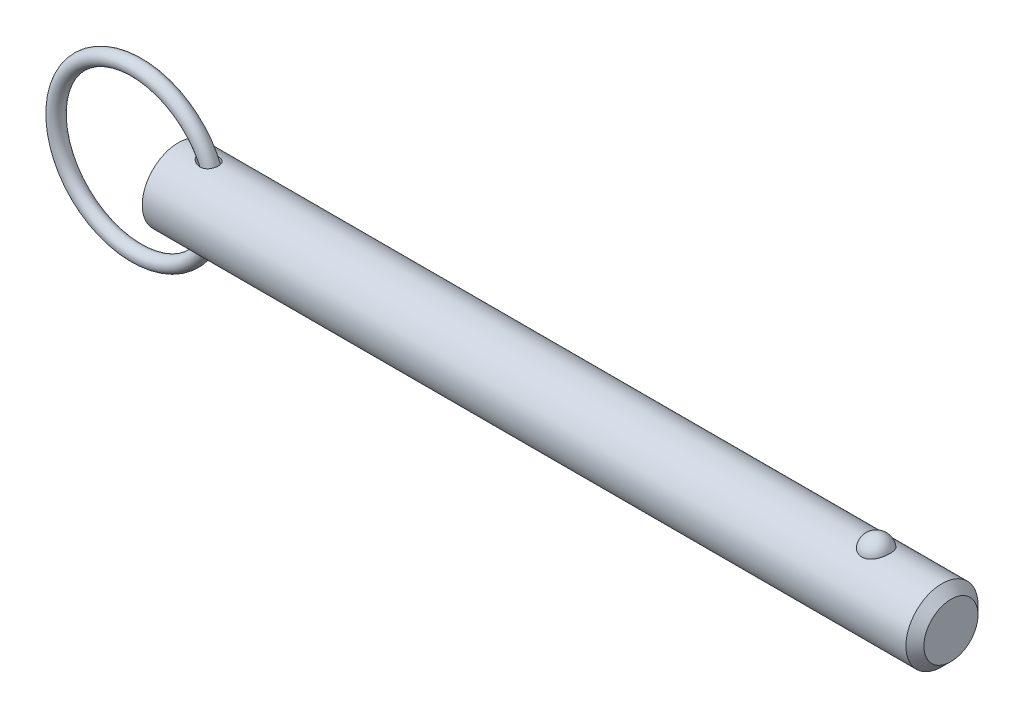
ISO-10303-21;
HEADER;
FILE_DESCRIPTION(('STEP AP214'),'2;1');
FILE_NAME('part.step','',(''),(''),'','','');
FILE_SCHEMA(('AUTOMOTIVE_DESIGN { 1 0 10303 214 1 1 1 1 }'));
ENDSEC;
DATA;
#1=APPLICATION_CONTEXT('core data for automotive mechanical design processes');
#2=APPLICATION_PROTOCOL_DEFINITION('international standard','automotive_design',2000,#1);
#3=PRODUCT_CONTEXT('',#1,'mechanical');
#4=PRODUCT('Part','Part','',(#3));
#5=PRODUCT_RELATED_PRODUCT_CATEGORY('part','',(#4));
#6=PRODUCT_DEFINITION_FORMATION('','',#4);
#7=PRODUCT_DEFINITION_CONTEXT('part definition',#1,'design');
#8=PRODUCT_DEFINITION('design','',#6,#7);
#9=PRODUCT_DEFINITION_SHAPE('','',#8);
#10=(LENGTH_UNIT() NAMED_UNIT(*) SI_UNIT(.MILLI.,.METRE.));
#11=(NAMED_UNIT(*) PLANE_ANGLE_UNIT() SI_UNIT($,.RADIAN.));
#12=(NAMED_UNIT(*) SI_UNIT($,.STERADIAN.) SOLID_ANGLE_UNIT());
#13=UNCERTAINTY_MEASURE_WITH_UNIT(LENGTH_MEASURE(1.E-05),#10,'distance_accuracy_value','');
#14=(GEOMETRIC_REPRESENTATION_CONTEXT(3) GLOBAL_UNCERTAINTY_ASSIGNED_CONTEXT((#13)) GLOBAL_UNIT_ASSIGNED_CONTEXT((#10,
#11,#12)) REPRESENTATION_CONTEXT('',''));
#15=CARTESIAN_POINT('',(0.,0.,0.));
#16=DIRECTION('',(0.,0.,1.));
#17=DIRECTION('',(1.,0.,0.));
#18=AXIS2_PLACEMENT_3D('',#15,#16,#17);
#19=CARTESIAN_POINT('',(-8.23730968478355,0.,0.));
#20=DIRECTION('',(0.,0.,1.));
#21=DIRECTION('',(1.,0.,0.));
#22=AXIS2_PLACEMENT_3D('',#19,#20,#21);
#23=TOROIDAL_SURFACE('',#22,15.875,1.422);
#24=CARTESIAN_POINT('',(9.05969031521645,0.,0.));
#25=VERTEX_POINT('',#24);
#26=VERTEX_LOOP('',#25);
#27=FACE_BOUND('',#26,.T.);
#28=ADVANCED_FACE('P0_F12',(#27),#23,.T.);
#29=CLOSED_SHELL('',(#28));
#30=MANIFOLD_SOLID_BREP('P0_B1',#29);
#31=CARTESIAN_POINT('',(0.,0.,0.));
#32=DIRECTION('',(1.,0.,0.));
#33=DIRECTION('',(0.,0.,-1.));
#34=AXIS2_PLACEMENT_3D('',#31,#32,#33);
#35=CYLINDRICAL_SURFACE('',#34,7.11);
#36=CARTESIAN_POINT('',(3.98467340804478,7.10072679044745,-0.363013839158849));
#37=CARTESIAN_POINT('',(4.00971652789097,7.09600153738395,-0.45539194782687));
#38=CARTESIAN_POINT('',(4.04401947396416,7.08958406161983,-0.545230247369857));
#39=CARTESIAN_POINT('',(4.12810160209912,7.07427055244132,-0.717157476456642));
#40=CARTESIAN_POINT('',(4.17791765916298,7.06536861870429,-0.799227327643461));
#41=CARTESIAN_POINT('',(4.28924471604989,7.04620300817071,-0.953469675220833));
#42=CARTESIAN_POINT('',(4.35063580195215,7.035953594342,-1.02573162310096));
#43=CARTESIAN_POINT('',(4.48282610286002,7.01493313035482,-1.16081412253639));
#44=CARTESIAN_POINT('',(4.55362244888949,7.00416223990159,-1.22363754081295));
#45=CARTESIAN_POINT('',(4.71659336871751,6.98090398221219,-1.35055080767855));
#46=CARTESIAN_POINT('',(4.81029272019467,6.96847103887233,-1.41269256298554));
#47=CARTESIAN_POINT('',(5.0057240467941,6.94515366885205,-1.52319699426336));
#48=CARTESIAN_POINT('',(5.10746392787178,6.93427079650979,-1.57154588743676));
#49=CARTESIAN_POINT('',(5.33503739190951,6.91346066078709,-1.66091325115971));
#50=CARTESIAN_POINT('',(5.46199550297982,6.90402388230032,-1.69921932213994));
#51=CARTESIAN_POINT('',(5.72084799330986,6.89024030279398,-1.75428261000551));
#52=CARTESIAN_POINT('',(5.85274301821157,6.88589416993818,-1.77103699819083));
#53=CARTESIAN_POINT('',(6.11557710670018,6.88337277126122,-1.78081990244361));
#54=CARTESIAN_POINT('',(6.24650031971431,6.88510489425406,-1.77420448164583));
#55=CARTESIAN_POINT('',(6.50446311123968,6.89478744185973,-1.73620392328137));
#56=CARTESIAN_POINT('',(6.6315075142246,6.90272978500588,-1.70485097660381));
#57=CARTESIAN_POINT('',(6.85933269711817,6.92243075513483,-1.62281888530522));
#58=CARTESIAN_POINT('',(6.96133251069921,6.93352131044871,-1.5753580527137));
#59=CARTESIAN_POINT('',(7.15436649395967,6.95824811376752,-1.46226310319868));
#60=CARTESIAN_POINT('',(7.24540699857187,6.97188287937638,-1.3966395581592));
#61=CARTESIAN_POINT('',(7.40446019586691,6.99838217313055,-1.25668991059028));
#62=CARTESIAN_POINT('',(7.473875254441,7.01118308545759,-1.18393777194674));
#63=CARTESIAN_POINT('',(7.59904891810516,7.03582803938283,-1.02736918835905));
#64=CARTESIAN_POINT('',(7.65481029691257,7.04767227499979,-0.943554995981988));
#65=CARTESIAN_POINT('',(7.74982438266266,7.06873077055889,-0.76979592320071));
#66=CARTESIAN_POINT('',(7.7894903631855,7.07800861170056,-0.680084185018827));
#67=CARTESIAN_POINT('',(7.85354088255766,7.09334756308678,-0.495102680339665));
#68=CARTESIAN_POINT('',(7.87792559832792,7.09940871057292,-0.399832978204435));
#69=CARTESIAN_POINT('',(7.9108898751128,7.10766731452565,-0.206294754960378));
#70=CARTESIAN_POINT('',(7.91944662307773,7.10985919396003,-0.108022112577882));
#71=CARTESIAN_POINT('',(7.920501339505,7.11012756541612,0.0886168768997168));
#72=CARTESIAN_POINT('',(7.91299895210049,7.10820396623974,0.186983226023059));
#73=CARTESIAN_POINT('',(7.88205794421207,7.10043733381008,0.381270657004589));
#74=CARTESIAN_POINT('',(7.85857985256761,7.09458459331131,0.477185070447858));
#75=CARTESIAN_POINT('',(7.79617406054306,7.07958431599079,0.663575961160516));
#76=CARTESIAN_POINT('',(7.75724672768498,7.07043685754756,0.754052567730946));
#77=CARTESIAN_POINT('',(7.66496731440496,7.04987259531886,0.926798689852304));
#78=CARTESIAN_POINT('',(7.61164530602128,7.0384605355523,1.00908483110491));
#79=CARTESIAN_POINT('',(7.49191707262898,7.01461776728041,1.16333092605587));
#80=CARTESIAN_POINT('',(7.42551210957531,7.00218715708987,1.235291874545));
#81=CARTESIAN_POINT('',(7.28164031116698,6.97770944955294,1.36680167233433));
#82=CARTESIAN_POINT('',(7.20420170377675,6.96566146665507,1.42638126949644));
#83=CARTESIAN_POINT('',(7.0403906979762,6.94319963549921,1.53199377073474));
#84=CARTESIAN_POINT('',(6.95401827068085,6.93278579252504,1.57802663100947));
#85=CARTESIAN_POINT('',(6.7731858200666,6.91444459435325,1.65656940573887));
#86=CARTESIAN_POINT('',(6.67860569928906,6.90656682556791,1.68881327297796));
#87=CARTESIAN_POINT('',(6.48544119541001,6.89422806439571,1.73849768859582));
#88=CARTESIAN_POINT('',(6.38685561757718,6.88976809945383,1.755933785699));
#89=CARTESIAN_POINT('',(6.18089829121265,6.88429907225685,1.77726234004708));
#90=CARTESIAN_POINT('',(6.07340937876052,6.88356485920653,1.78007646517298));
#91=CARTESIAN_POINT('',(5.85921220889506,6.886086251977,1.77029087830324));
#92=CARTESIAN_POINT('',(5.75250426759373,6.88934339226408,1.75768523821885));
#93=CARTESIAN_POINT('',(5.52848027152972,6.89994454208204,1.71563399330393));
#94=CARTESIAN_POINT('',(5.41155168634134,6.90775772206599,1.68424184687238));
#95=CARTESIAN_POINT('',(5.18376466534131,6.92670168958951,1.60454711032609));
#96=CARTESIAN_POINT('',(5.07291446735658,6.9378368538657,1.5562221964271));
#97=CARTESIAN_POINT('',(4.84835244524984,6.96347168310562,1.43744827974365));
#98=CARTESIAN_POINT('',(4.73562531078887,6.97820486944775,1.36517310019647));
#99=CARTESIAN_POINT('',(4.52504912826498,7.00822340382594,1.20158053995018));
#100=CARTESIAN_POINT('',(4.42717478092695,7.02350775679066,1.11029618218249));
#101=CARTESIAN_POINT('',(4.27935716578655,7.04784659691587,0.940654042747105));
#102=CARTESIAN_POINT('',(4.2239722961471,7.05736064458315,0.867099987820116));
#103=CARTESIAN_POINT('',(4.12558347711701,7.07469854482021,0.711919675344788));
#104=CARTESIAN_POINT('',(4.08256922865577,7.0825238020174,0.630300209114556));
#105=CARTESIAN_POINT('',(4.01142860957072,7.09565978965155,0.459428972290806));
#106=CARTESIAN_POINT('',(3.98346043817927,7.10094374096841,0.370107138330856));
#107=CARTESIAN_POINT('',(3.95517285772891,7.1063173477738,0.233358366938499));
#108=CARTESIAN_POINT('',(3.94802115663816,7.1076831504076,0.187321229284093));
#109=CARTESIAN_POINT('',(3.93842121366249,7.10951900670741,0.0947476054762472));
#110=CARTESIAN_POINT('',(3.93597129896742,7.10998937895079,0.0482113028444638));
#111=CARTESIAN_POINT('',(3.93584361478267,7.11001358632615,-0.0598597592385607));
#112=CARTESIAN_POINT('',(3.9399538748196,7.10922402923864,-0.121405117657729));
#113=CARTESIAN_POINT('',(3.95632793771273,7.10609781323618,-0.243320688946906));
#114=CARTESIAN_POINT('',(3.96859135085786,7.10376122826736,-0.303690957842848));
#115=CARTESIAN_POINT('',(3.98467340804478,7.10072679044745,-0.363013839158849));
#116=B_SPLINE_CURVE_WITH_KNOTS('',3,(#36,#37,#38,#39,#40,#41,#42,#43,#44,#45,#46,#47,#48,#49,
#50,#51,#52,#53,#54,#55,#56,#57,#58,#59,#60,#61,#62,#63,#64,#65,#66,#67,#68,#69,#70,#71,#72,#73,
#74,#75,#76,#77,#78,#79,#80,#81,#82,#83,#84,#85,#86,#87,#88,#89,#90,#91,#92,#93,#94,#95,#96,#97,
#98,#99,#100,#101,#102,#103,#104,#105,#106,#107,#108,#109,#110,#111,#112,#113,#114,#115),
.UNSPECIFIED.,.T.,.F.,(4,2,2,2,2,2,2,2,2,2,2,2,2,2,2,2,2,2,2,2,2,2,2,2,2,2,2,2,2,2,2,2,2,2,2,2,
2,2,2,4),(0.,0.287206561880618,0.575101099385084,0.860162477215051,1.14513709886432,
1.48324846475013,1.82169652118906,2.21865672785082,2.6156690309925,3.00665870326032,
3.39714041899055,3.73437585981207,4.07141541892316,4.37402271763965,4.67656849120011,
4.97076150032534,5.26495110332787,5.55956439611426,5.85418421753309,6.14953461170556,
6.44487798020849,6.73960905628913,7.03431171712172,7.32827352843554,7.6222362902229,
7.9216396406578,8.22113296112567,8.54242840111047,8.86384740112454,9.22635035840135,
9.58933304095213,9.99153142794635,10.3930368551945,10.6697219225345,10.9461759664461,
11.2254825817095,11.3650959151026,11.5046595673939,11.6891051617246,11.8735419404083),.UNSPECIFIED.);
#117=CARTESIAN_POINT('',(3.98467340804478,7.10072679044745,-0.363013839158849));
#118=VERTEX_POINT('',#117);
#119=EDGE_CURVE('P1_E40',#118,#118,#116,.T.);
#120=ORIENTED_EDGE('',*,*,#119,.T.);
#121=EDGE_LOOP('',(#120));
#122=FACE_BOUND('',#121,.T.);
#123=CARTESIAN_POINT('',(150.5925,0.,0.));
#124=DIRECTION('',(1.,0.,0.));
#125=DIRECTION('',(0.,0.,-1.));
#126=AXIS2_PLACEMENT_3D('',#123,#124,#125);
#127=CIRCLE('',#126,7.11);
#128=CARTESIAN_POINT('',(150.5925,0.,-7.11));
#129=VERTEX_POINT('',#128);
#130=EDGE_CURVE('P1_E25',#129,#129,#127,.T.);
#131=ORIENTED_EDGE('',*,*,#130,.F.);
#132=EDGE_LOOP('',(#131));
#133=FACE_BOUND('',#132,.T.);
#134=CARTESIAN_POINT('',(0.,0.,0.));
#135=DIRECTION('',(1.,0.,0.));
#136=DIRECTION('',(0.,0.,-1.));
#137=AXIS2_PLACEMENT_3D('',#134,#135,#136);
#138=CIRCLE('',#137,7.11);
#139=CARTESIAN_POINT('',(0.,0.,-7.11));
#140=VERTEX_POINT('',#139);
#141=EDGE_CURVE('P1_E9',#140,#140,#138,.T.);
#142=ORIENTED_EDGE('',*,*,#141,.T.);
#143=EDGE_LOOP('',(#142));
#144=FACE_BOUND('',#143,.T.);
#145=CARTESIAN_POINT('',(137.629258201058,6.5364666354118,2.79762469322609));
#146=CARTESIAN_POINT('',(137.484429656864,6.53647876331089,2.79761243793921));
#147=CARTESIAN_POINT('',(137.339368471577,6.54144531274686,2.78608115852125));
#148=CARTESIAN_POINT('',(137.053292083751,6.56077791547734,2.7402328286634));
#149=CARTESIAN_POINT('',(136.91228845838,6.5751685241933,2.7058562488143));
#150=CARTESIAN_POINT('',(136.63888335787,6.61165072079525,2.61544042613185));
#151=CARTESIAN_POINT('',(136.506460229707,6.63372195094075,2.55945840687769));
#152=CARTESIAN_POINT('',(136.253233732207,6.6831601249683,2.42742958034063));
#153=CARTESIAN_POINT('',(136.132425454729,6.71052481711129,2.35139129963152));
#154=CARTESIAN_POINT('',(135.901637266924,6.76860821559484,2.17866150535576));
#155=CARTESIAN_POINT('',(135.792085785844,6.79940242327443,2.0814234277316));
#156=CARTESIAN_POINT('',(135.59033404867,6.86050242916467,1.87020907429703));
#157=CARTESIAN_POINT('',(135.498139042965,6.89080807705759,1.75622775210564));
#158=CARTESIAN_POINT('',(135.32925478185,6.94923069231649,1.50900646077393));
#159=CARTESIAN_POINT('',(135.253428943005,6.97719213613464,1.3751387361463));
#160=CARTESIAN_POINT('',(135.124206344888,7.02647251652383,1.09584817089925));
#161=CARTESIAN_POINT('',(135.070810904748,7.04779106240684,0.950424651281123));
#162=CARTESIAN_POINT('',(134.987101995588,7.08180248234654,0.650508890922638));
#163=CARTESIAN_POINT('',(134.957025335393,7.09440672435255,0.495940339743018));
#164=CARTESIAN_POINT('',(134.921473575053,7.10935121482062,0.183515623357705));
#165=CARTESIAN_POINT('',(134.915997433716,7.11169189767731,0.025659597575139));
#166=CARTESIAN_POINT('',(134.929700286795,7.10589702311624,-0.287512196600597));
#167=CARTESIAN_POINT('',(134.94868231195,7.0978451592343,-0.442838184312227));
#168=CARTESIAN_POINT('',(135.01057450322,7.07221860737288,-0.747830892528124));
#169=CARTESIAN_POINT('',(135.053485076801,7.05464375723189,-0.897497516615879));
#170=CARTESIAN_POINT('',(135.162452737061,7.01171031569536,-1.18722864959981));
#171=CARTESIAN_POINT('',(135.228545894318,6.98633960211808,-1.32727778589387));
#172=CARTESIAN_POINT('',(135.382536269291,6.93042258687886,-1.59370324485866));
#173=CARTESIAN_POINT('',(135.470435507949,6.89987580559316,-1.72007829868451));
#174=CARTESIAN_POINT('',(135.666926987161,6.83659510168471,-1.95657345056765));
#175=CARTESIAN_POINT('',(135.775664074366,6.80384697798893,-2.0665695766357));
#176=CARTESIAN_POINT('',(136.010968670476,6.7400183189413,-2.26611005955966));
#177=CARTESIAN_POINT('',(136.137535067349,6.70893767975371,-2.35565569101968));
#178=CARTESIAN_POINT('',(136.402845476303,6.65264442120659,-2.51019726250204));
#179=CARTESIAN_POINT('',(136.541323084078,6.62733449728,-2.57561395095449));
#180=CARTESIAN_POINT('',(136.828519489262,6.58495995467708,-2.68211134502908));
#181=CARTESIAN_POINT('',(136.977234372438,6.56789220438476,-2.7232012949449));
#182=CARTESIAN_POINT('',(137.272626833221,6.54478663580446,-2.7782581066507));
#183=CARTESIAN_POINT('',(137.41902951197,6.53823639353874,-2.79348727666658));
#184=CARTESIAN_POINT('',(137.712470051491,6.53532718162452,-2.80028921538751));
#185=CARTESIAN_POINT('',(137.859507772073,6.53896606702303,-2.7918669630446));
#186=CARTESIAN_POINT('',(138.144921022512,6.55570357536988,-2.75232178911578));
#187=CARTESIAN_POINT('',(138.283422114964,6.56848455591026,-2.72196077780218));
#188=CARTESIAN_POINT('',(138.553114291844,6.60173528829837,-2.64028774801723));
#189=CARTESIAN_POINT('',(138.684304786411,6.62220565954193,-2.58897404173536));
#190=CARTESIAN_POINT('',(138.938846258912,6.66917927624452,-2.46547820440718));
#191=CARTESIAN_POINT('',(139.061969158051,6.69580233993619,-2.39287266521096));
#192=CARTESIAN_POINT('',(139.294441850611,6.75207041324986,-2.22915269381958));
#193=CARTESIAN_POINT('',(139.403788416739,6.78171612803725,-2.13803393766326));
#194=CARTESIAN_POINT('',(139.611642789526,6.84264629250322,-1.93445592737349));
#195=CARTESIAN_POINT('',(139.709317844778,6.87393748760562,-1.82114774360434));
#196=CARTESIAN_POINT('',(139.885011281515,6.93345710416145,-1.57947787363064));
#197=CARTESIAN_POINT('',(139.963026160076,6.96168497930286,-1.45111351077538));
#198=CARTESIAN_POINT('',(140.099985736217,7.01307558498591,-1.17842708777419));
#199=CARTESIAN_POINT('',(140.158258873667,7.03605262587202,-1.03373189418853));
#200=CARTESIAN_POINT('',(140.251081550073,7.07340932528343,-0.735867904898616));
#201=CARTESIAN_POINT('',(140.285631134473,7.08778900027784,-0.582699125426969));
#202=CARTESIAN_POINT('',(140.330274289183,7.10647639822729,-0.272420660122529));
#203=CARTESIAN_POINT('',(140.34039710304,7.11079616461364,-0.115315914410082));
#204=CARTESIAN_POINT('',(140.336061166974,7.10896059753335,0.198488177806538));
#205=CARTESIAN_POINT('',(140.321603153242,7.10280557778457,0.355187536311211));
#206=CARTESIAN_POINT('',(140.268572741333,7.08071500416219,0.662724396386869));
#207=CARTESIAN_POINT('',(140.23015058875,7.06484039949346,0.813592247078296));
#208=CARTESIAN_POINT('',(140.130101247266,7.0249589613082,1.10629159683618));
#209=CARTESIAN_POINT('',(140.068472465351,7.00095156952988,1.24812247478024));
#210=CARTESIAN_POINT('',(139.922766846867,6.94706632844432,1.51976439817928));
#211=CARTESIAN_POINT('',(139.838544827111,6.91715085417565,1.6494901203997));
#212=CARTESIAN_POINT('',(139.649586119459,6.85470565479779,1.89231285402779));
#213=CARTESIAN_POINT('',(139.544850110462,6.82217601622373,2.0054104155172));
#214=CARTESIAN_POINT('',(139.317103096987,6.75805358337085,2.21190674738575));
#215=CARTESIAN_POINT('',(139.194082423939,6.72646129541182,2.30529503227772));
#216=CARTESIAN_POINT('',(138.93273470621,6.66789520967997,2.46959908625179));
#217=CARTESIAN_POINT('',(138.794401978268,6.64092313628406,2.54050647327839));
#218=CARTESIAN_POINT('',(138.511182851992,6.5957258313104,2.65560045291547));
#219=CARTESIAN_POINT('',(138.366666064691,6.57724013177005,2.70059539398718));
#220=CARTESIAN_POINT('',(138.071546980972,6.55006426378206,2.76587321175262));
#221=CARTESIAN_POINT('',(137.920964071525,6.54134511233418,2.78622922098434));
#222=CARTESIAN_POINT('',(137.723046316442,6.53697847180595,2.79642434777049));
#223=CARTESIAN_POINT('',(137.676164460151,6.53646270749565,2.79762866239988));
#224=CARTESIAN_POINT('',(137.629258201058,6.5364666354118,2.79762469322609));
#225=B_SPLINE_CURVE_WITH_KNOTS('',3,(#145,#146,#147,#148,#149,#150,#151,#152,#153,#154,#155,
#156,#157,#158,#159,#160,#161,#162,#163,#164,#165,#166,#167,#168,#169,#170,#171,#172,#173,#174,
#175,#176,#177,#178,#179,#180,#181,#182,#183,#184,#185,#186,#187,#188,#189,#190,#191,#192,#193,
#194,#195,#196,#197,#198,#199,#200,#201,#202,#203,#204,#205,#206,#207,#208,#209,#210,#211,#212,
#213,#214,#215,#216,#217,#218,#219,#220,#221,#222,#223,#224),.UNSPECIFIED.,.T.,.F.,(4,2,2,2,2,2,
2,2,2,2,2,2,2,2,2,2,2,2,2,2,2,2,2,2,2,2,2,2,2,2,2,2,2,2,2,2,2,2,2,4),(0.,0.43435572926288,
0.86984774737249,1.30419416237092,1.73835621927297,2.18541922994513,2.63261726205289,
3.09954261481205,3.56649542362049,4.03813031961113,4.50974525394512,4.97758575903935,
5.44543423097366,5.91401389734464,6.38263700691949,6.85464418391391,7.32662193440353,
7.7899297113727,8.25306131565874,8.69285754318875,9.13256119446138,9.55768625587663,
9.98284556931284,10.4171106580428,10.8514772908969,11.3079089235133,11.7644218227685,
12.2351898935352,12.7059570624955,13.1761603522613,13.6463495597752,14.1136200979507,
14.580922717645,15.0513032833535,15.5216682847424,15.9922828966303,16.4630727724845,
16.9182457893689,17.372064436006,17.5127411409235),.UNSPECIFIED.);
#226=CARTESIAN_POINT('',(137.629258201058,6.5364666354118,2.79762469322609));
#227=VERTEX_POINT('',#226);
#228=EDGE_CURVE('P1_E34',#227,#227,#225,.T.);
#229=ORIENTED_EDGE('',*,*,#228,.T.);
#230=EDGE_LOOP('',(#229));
#231=FACE_BOUND('',#230,.T.);
#232=CARTESIAN_POINT('',(3.98467340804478,-7.10072679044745,-0.363013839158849));
#233=CARTESIAN_POINT('',(3.96426456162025,-7.10457733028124,-0.287714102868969));
#234=CARTESIAN_POINT('',(3.95000501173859,-7.10730349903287,-0.210695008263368));
#235=CARTESIAN_POINT('',(3.93481801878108,-7.11020840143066,-0.0553038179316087));
#236=CARTESIAN_POINT('',(3.93388435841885,-7.11038832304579,0.0230676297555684));
#237=CARTESIAN_POINT('',(3.94541910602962,-7.10817995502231,0.178714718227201));
#238=CARTESIAN_POINT('',(3.95787987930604,-7.10579312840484,0.25599095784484));
#239=CARTESIAN_POINT('',(3.99523775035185,-7.09872642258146,0.407352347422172));
#240=CARTESIAN_POINT('',(4.02014065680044,-7.09404547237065,0.481435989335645));
#241=CARTESIAN_POINT('',(4.08119600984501,-7.08278363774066,0.625775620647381));
#242=CARTESIAN_POINT('',(4.11749458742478,-7.07617815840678,0.695967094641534));
#243=CARTESIAN_POINT('',(4.19940836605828,-7.06165305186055,0.830508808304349));
#244=CARTESIAN_POINT('',(4.24502952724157,-7.0537325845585,0.894855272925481));
#245=CARTESIAN_POINT('',(4.36790232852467,-7.03310314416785,1.04688574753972));
#246=CARTESIAN_POINT('',(4.44977459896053,-7.01993229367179,1.13078695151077));
#247=CARTESIAN_POINT('',(4.62610796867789,-6.99351259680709,1.28411726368));
#248=CARTESIAN_POINT('',(4.7205898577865,-6.98026365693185,1.35352197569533));
#249=CARTESIAN_POINT('',(4.92036507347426,-6.9549104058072,1.47831921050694));
#250=CARTESIAN_POINT('',(5.02579054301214,-6.94282458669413,1.53350332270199));
#251=CARTESIAN_POINT('',(5.24378330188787,-6.92129098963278,1.62793610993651));
#252=CARTESIAN_POINT('',(5.35635066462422,-6.91184323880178,1.66718462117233));
#253=CARTESIAN_POINT('',(5.60134354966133,-6.89573491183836,1.73269893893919));
#254=CARTESIAN_POINT('',(5.73444697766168,-6.8895970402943,1.75661057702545));
#255=CARTESIAN_POINT('',(6.00300738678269,-6.88344616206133,1.78057487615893));
#256=CARTESIAN_POINT('',(6.13846360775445,-6.88343121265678,1.78063510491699));
#257=CARTESIAN_POINT('',(6.39660470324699,-6.88981379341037,1.75576480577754));
#258=CARTESIAN_POINT('',(6.51947843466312,-6.89572457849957,1.73273121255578));
#259=CARTESIAN_POINT('',(6.75813770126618,-6.91274434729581,1.66352936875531));
#260=CARTESIAN_POINT('',(6.87393155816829,-6.92384709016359,1.61738888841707));
#261=CARTESIAN_POINT('',(7.07801861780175,-6.94787316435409,1.51052664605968));
#262=CARTESIAN_POINT('',(7.16789841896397,-6.96033024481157,1.45271574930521));
#263=CARTESIAN_POINT('',(7.33546773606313,-6.98638661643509,1.32171912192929));
#264=CARTESIAN_POINT('',(7.41316182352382,-6.99998547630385,1.24853918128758));
#265=CARTESIAN_POINT('',(7.54861420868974,-7.02559503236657,1.09486170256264));
#266=CARTESIAN_POINT('',(7.60741145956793,-7.03764930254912,1.01528346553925));
#267=CARTESIAN_POINT('',(7.71070740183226,-7.0598657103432,0.847099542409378));
#268=CARTESIAN_POINT('',(7.75520788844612,-7.0700280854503,0.758494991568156));
#269=CARTESIAN_POINT('',(7.82836147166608,-7.08722075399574,0.575936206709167));
#270=CARTESIAN_POINT('',(7.85719783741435,-7.09428707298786,0.482058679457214));
#271=CARTESIAN_POINT('',(7.89918378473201,-7.10470260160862,0.29065874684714));
#272=CARTESIAN_POINT('',(7.91233308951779,-7.10805174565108,0.193136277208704));
#273=CARTESIAN_POINT('',(7.92267451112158,-7.11067890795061,-0.00313968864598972));
#274=CARTESIAN_POINT('',(7.91981203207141,-7.10994299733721,-0.10189624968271));
#275=CARTESIAN_POINT('',(7.89806489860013,-7.10444651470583,-0.297516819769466));
#276=CARTESIAN_POINT('',(7.87918005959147,-7.09968589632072,-0.394380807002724));
#277=CARTESIAN_POINT('',(7.82577988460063,-7.0866471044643,-0.58355375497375));
#278=CARTESIAN_POINT('',(7.79124976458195,-7.07836560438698,-0.675858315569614));
#279=CARTESIAN_POINT('',(7.70736343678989,-7.05919003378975,-0.853167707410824));
#280=CARTESIAN_POINT('',(7.65800801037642,-7.04829610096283,-0.938172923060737));
#281=CARTESIAN_POINT('',(7.54590141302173,-7.02513961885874,-1.09819812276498));
#282=CARTESIAN_POINT('',(7.48319521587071,-7.01288172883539,-1.17325029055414));
#283=CARTESIAN_POINT('',(7.34599775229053,-6.98832192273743,-1.31164333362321));
#284=CARTESIAN_POINT('',(7.27150757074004,-6.97602001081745,-1.37498528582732));
#285=CARTESIAN_POINT('',(7.11277776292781,-6.95268608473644,-1.48849974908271));
#286=CARTESIAN_POINT('',(7.02852525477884,-6.94165578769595,-1.53865456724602));
#287=CARTESIAN_POINT('',(6.85282430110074,-6.92200320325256,-1.62478650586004));
#288=CARTESIAN_POINT('',(6.76137511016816,-6.91338116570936,-1.66076215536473));
#289=CARTESIAN_POINT('',(6.57061179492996,-6.89906044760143,-1.71930563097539));
#290=CARTESIAN_POINT('',(6.47113516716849,-6.89347290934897,-1.74136795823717));
#291=CARTESIAN_POINT('',(6.26989833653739,-6.88605020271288,-1.7704895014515));
#292=CARTESIAN_POINT('',(6.16813737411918,-6.88421630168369,-1.77754365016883));
#293=CARTESIAN_POINT('',(5.95492537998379,-6.88424071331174,-1.77745174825));
#294=CARTESIAN_POINT('',(5.8434768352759,-6.88646827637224,-1.76888555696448));
#295=CARTESIAN_POINT('',(5.62307560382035,-6.89483827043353,-1.73596677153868));
#296=CARTESIAN_POINT('',(5.51412477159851,-6.90098351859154,-1.71160281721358));
#297=CARTESIAN_POINT('',(5.28644478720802,-6.91743803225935,-1.64393691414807));
#298=CARTESIAN_POINT('',(5.16837217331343,-6.92819628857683,-1.59852806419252));
#299=CARTESIAN_POINT('',(4.94091825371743,-6.95234836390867,-1.4899796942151));
#300=CARTESIAN_POINT('',(4.83153887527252,-6.96574276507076,-1.42683625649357));
#301=CARTESIAN_POINT('',(4.63576710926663,-6.99209234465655,-1.29112257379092));
#302=CARTESIAN_POINT('',(4.54816728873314,-7.00494184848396,-1.22027748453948));
#303=CARTESIAN_POINT('',(4.38554897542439,-7.03019055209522,-1.0652111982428));
#304=CARTESIAN_POINT('',(4.31052141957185,-7.04259007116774,-0.980999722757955));
#305=CARTESIAN_POINT('',(4.18551811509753,-7.0640229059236,-0.811206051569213));
#306=CARTESIAN_POINT('',(4.13358417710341,-7.07328321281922,-0.727107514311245));
#307=CARTESIAN_POINT('',(4.04607461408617,-7.0891994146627,-0.550580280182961));
#308=CARTESIAN_POINT('',(4.01046401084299,-7.09586087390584,-0.458169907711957));
#309=CARTESIAN_POINT('',(3.98467340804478,-7.10072679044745,-0.363013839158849));
#310=B_SPLINE_CURVE_WITH_KNOTS('',3,(#232,#233,#234,#235,#236,#237,#238,#239,#240,#241,#242,
#243,#244,#245,#246,#247,#248,#249,#250,#251,#252,#253,#254,#255,#256,#257,#258,#259,#260,#261,
#262,#263,#264,#265,#266,#267,#268,#269,#270,#271,#272,#273,#274,#275,#276,#277,#278,#279,#280,
#281,#282,#283,#284,#285,#286,#287,#288,#289,#290,#291,#292,#293,#294,#295,#296,#297,#298,#299,
#300,#301,#302,#303,#304,#305,#306,#307,#308,#309),.UNSPECIFIED.,.T.,.F.,(4,2,2,2,2,2,2,2,2,2,2,
2,2,2,2,2,2,2,2,2,2,2,2,2,2,2,2,2,2,2,2,2,2,2,2,2,2,2,4),(0.,0.23402065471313,0.467932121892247,
0.701710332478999,0.935597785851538,1.17261620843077,1.40978663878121,1.76177576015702,
2.11435255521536,2.47183528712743,2.8293216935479,3.23332937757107,3.63720887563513,
4.01042610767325,4.38319587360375,4.70425151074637,5.02518641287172,5.32277979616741,
5.62033579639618,5.91433101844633,6.2083314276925,6.50333490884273,6.79834178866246,
7.09362801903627,7.38889868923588,7.6831900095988,7.9774542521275,8.27211131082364,
8.56679892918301,8.8716552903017,9.17661456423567,9.51069129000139,9.84500851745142,
10.2243046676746,10.6036846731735,10.9425776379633,11.2812252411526,11.5775945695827,
11.8733258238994),.UNSPECIFIED.);
#311=CARTESIAN_POINT('',(3.98467340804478,-7.10072679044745,-0.363013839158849));
#312=VERTEX_POINT('',#311);
#313=EDGE_CURVE('P1_E17',#312,#312,#310,.T.);
#314=ORIENTED_EDGE('',*,*,#313,.T.);
#315=EDGE_LOOP('',(#314));
#316=FACE_BOUND('',#315,.T.);
#317=ADVANCED_FACE('P1_F13',(#122,#133,#144,#231,#316),#35,.T.);
#318=CARTESIAN_POINT('',(0.,0.,0.));
#319=DIRECTION('',(-1.,0.,0.));
#320=DIRECTION('',(0.,0.,1.));
#321=AXIS2_PLACEMENT_3D('',#318,#319,#320);
#322=PLANE('',#321);
#323=ORIENTED_EDGE('',*,*,#141,.F.);
#324=EDGE_LOOP('',(#323));
#325=FACE_BOUND('',#324,.T.);
#326=ADVANCED_FACE('P1_F15',(#325),#322,.T.);
#327=CARTESIAN_POINT('',(152.37,0.,0.));
#328=DIRECTION('',(-1.,0.,0.));
#329=DIRECTION('',(0.,0.,1.));
#330=AXIS2_PLACEMENT_3D('',#327,#328,#329);
#331=CONICAL_SURFACE('',#330,5.33250000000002,0.785398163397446);
#332=ORIENTED_EDGE('',*,*,#130,.T.);
#333=EDGE_LOOP('',(#332));
#334=FACE_BOUND('',#333,.T.);
#335=CARTESIAN_POINT('',(152.37,0.,0.));
#336=DIRECTION('',(1.,0.,0.));
#337=DIRECTION('',(0.,0.,-1.));
#338=AXIS2_PLACEMENT_3D('',#335,#336,#337);
#339=CIRCLE('',#338,5.33250000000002);
#340=CARTESIAN_POINT('',(152.37,0.,-5.33250000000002));
#341=VERTEX_POINT('',#340);
#342=EDGE_CURVE('P1_E30',#341,#341,#339,.T.);
#343=ORIENTED_EDGE('',*,*,#342,.F.);
#344=EDGE_LOOP('',(#343));
#345=FACE_BOUND('',#344,.T.);
#346=ADVANCED_FACE('P1_F55',(#334,#345),#331,.T.);
#347=CARTESIAN_POINT('',(152.37,5.33250000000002,0.));
#348=DIRECTION('',(1.,0.,0.));
#349=DIRECTION('',(0.,0.,-1.));
#350=AXIS2_PLACEMENT_3D('',#347,#348,#349);
#351=PLANE('',#350);
#352=ORIENTED_EDGE('',*,*,#342,.T.);
#353=EDGE_LOOP('',(#352));
#354=FACE_BOUND('',#353,.T.);
#355=ADVANCED_FACE('P1_F51',(#354),#351,.T.);
#356=CARTESIAN_POINT('',(137.629258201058,6.399,0.));
#357=DIRECTION('',(-1.,0.,0.));
#358=DIRECTION('',(0.,1.,0.));
#359=AXIS2_PLACEMENT_3D('',#356,#357,#358);
#360=SPHERICAL_SURFACE('',#359,2.80099999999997);
#361=ORIENTED_EDGE('',*,*,#228,.F.);
#362=EDGE_LOOP('',(#361));
#363=FACE_BOUND('',#362,.T.);
#364=ADVANCED_FACE('P1_F46',(#363),#360,.T.);
#365=CARTESIAN_POINT('',(-8.23730968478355,0.,0.));
#366=DIRECTION('',(0.,0.,1.));
#367=DIRECTION('',(1.,0.,0.));
#368=AXIS2_PLACEMENT_3D('',#365,#366,#367);
#369=TOROIDAL_SURFACE('',#368,15.875,1.7775);
#370=ORIENTED_EDGE('',*,*,#313,.F.);
#371=EDGE_LOOP('',(#370));
#372=FACE_BOUND('',#371,.T.);
#373=ORIENTED_EDGE('',*,*,#119,.F.);
#374=EDGE_LOOP('',(#373));
#375=FACE_BOUND('',#374,.T.);
#376=ADVANCED_FACE('P1_F50',(#372,#375),#369,.F.);
#377=CLOSED_SHELL('',(#317,#326,#346,#355,#364,#376));
#378=MANIFOLD_SOLID_BREP('P1_B1',#377);
#379=ADVANCED_BREP_SHAPE_REPRESENTATION('',(#18,#30,#378),#14);
#380=SHAPE_DEFINITION_REPRESENTATION(#9,#379);
ENDSEC;
END-ISO-10303-21;
